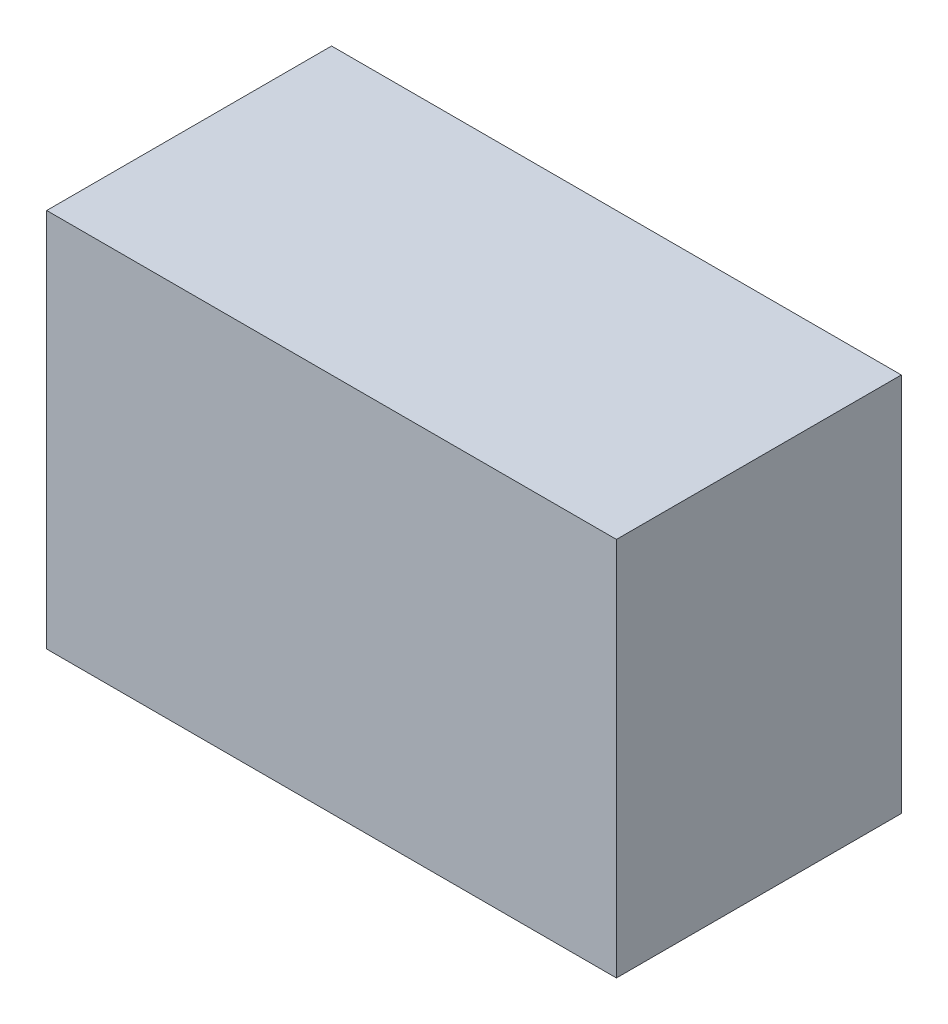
from build123d import *

# Parameters (mm, degrees)
ESQUISSE1_W      = 45
ESQUISSE1_H      = 30
EXTRUSION1_DEPTH = 22.5


with BuildPart() as part:
    # Esquisse1 → Extrusion1 (new body)
    with BuildSketch(Plane.XY):
        with Locations((157.5, -15)):
            Rectangle(ESQUISSE1_W, ESQUISSE1_H)
    extrude(amount=EXTRUSION1_DEPTH)


solid = part.part
